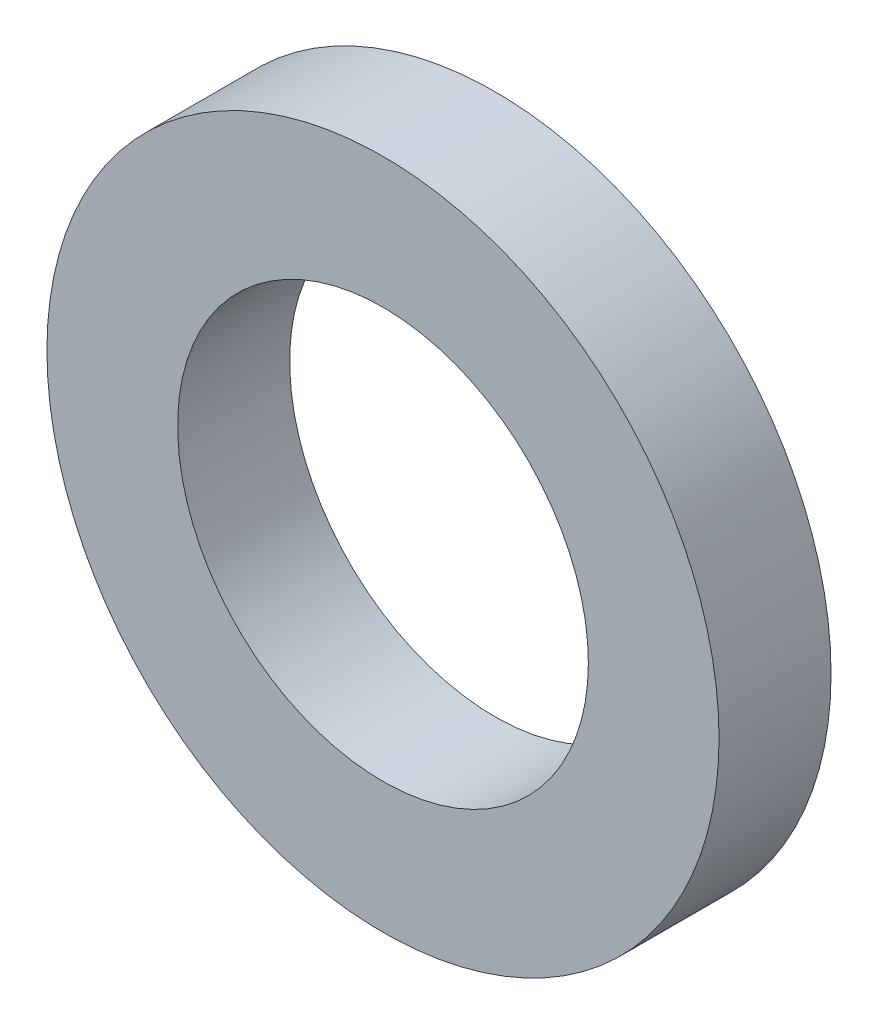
ISO-10303-21;
HEADER;
FILE_DESCRIPTION(('STEP AP214'),'2;1');
FILE_NAME('part.step','',(''),(''),'','','');
FILE_SCHEMA(('AUTOMOTIVE_DESIGN { 1 0 10303 214 1 1 1 1 }'));
ENDSEC;
DATA;
#1=APPLICATION_CONTEXT('core data for automotive mechanical design processes');
#2=APPLICATION_PROTOCOL_DEFINITION('international standard','automotive_design',2000,#1);
#3=PRODUCT_CONTEXT('',#1,'mechanical');
#4=PRODUCT('Part','Part','',(#3));
#5=PRODUCT_RELATED_PRODUCT_CATEGORY('part','',(#4));
#6=PRODUCT_DEFINITION_FORMATION('','',#4);
#7=PRODUCT_DEFINITION_CONTEXT('part definition',#1,'design');
#8=PRODUCT_DEFINITION('design','',#6,#7);
#9=PRODUCT_DEFINITION_SHAPE('','',#8);
#10=(LENGTH_UNIT() NAMED_UNIT(*) SI_UNIT(.MILLI.,.METRE.));
#11=(NAMED_UNIT(*) PLANE_ANGLE_UNIT() SI_UNIT($,.RADIAN.));
#12=(NAMED_UNIT(*) SI_UNIT($,.STERADIAN.) SOLID_ANGLE_UNIT());
#13=UNCERTAINTY_MEASURE_WITH_UNIT(LENGTH_MEASURE(1.E-05),#10,'distance_accuracy_value','');
#14=(GEOMETRIC_REPRESENTATION_CONTEXT(3) GLOBAL_UNCERTAINTY_ASSIGNED_CONTEXT((#13)) GLOBAL_UNIT_ASSIGNED_CONTEXT((#10,
#11,#12)) REPRESENTATION_CONTEXT('',''));
#15=CARTESIAN_POINT('',(0.,0.,0.));
#16=DIRECTION('',(0.,0.,1.));
#17=DIRECTION('',(1.,0.,0.));
#18=AXIS2_PLACEMENT_3D('',#15,#16,#17);
#19=CARTESIAN_POINT('',(0.,0.,1.5));
#20=DIRECTION('',(0.,0.,-1.));
#21=DIRECTION('',(-1.,0.,0.));
#22=AXIS2_PLACEMENT_3D('',#19,#20,#21);
#23=CYLINDRICAL_SURFACE('',#22,4.5);
#24=CARTESIAN_POINT('',(0.,0.,1.5));
#25=DIRECTION('',(0.,0.,1.));
#26=DIRECTION('',(1.,0.,0.));
#27=AXIS2_PLACEMENT_3D('',#24,#25,#26);
#28=CIRCLE('',#27,4.5);
#29=CARTESIAN_POINT('',(4.5,0.,1.5));
#30=VERTEX_POINT('',#29);
#31=EDGE_CURVE('E10',#30,#30,#28,.T.);
#32=ORIENTED_EDGE('',*,*,#31,.F.);
#33=EDGE_LOOP('',(#32));
#34=FACE_BOUND('',#33,.T.);
#35=CARTESIAN_POINT('',(0.,0.,0.));
#36=DIRECTION('',(0.,0.,1.));
#37=DIRECTION('',(1.,0.,0.));
#38=AXIS2_PLACEMENT_3D('',#35,#36,#37);
#39=CIRCLE('',#38,4.5);
#40=CARTESIAN_POINT('',(4.5,0.,0.));
#41=VERTEX_POINT('',#40);
#42=EDGE_CURVE('E37',#41,#41,#39,.T.);
#43=ORIENTED_EDGE('',*,*,#42,.T.);
#44=EDGE_LOOP('',(#43));
#45=FACE_BOUND('',#44,.T.);
#46=ADVANCED_FACE('F31',(#34,#45),#23,.T.);
#47=CARTESIAN_POINT('',(0.,0.,1.5));
#48=DIRECTION('',(0.,0.,1.));
#49=DIRECTION('',(1.,0.,0.));
#50=AXIS2_PLACEMENT_3D('',#47,#48,#49);
#51=PLANE('',#50);
#52=CARTESIAN_POINT('',(0.,0.,1.5));
#53=DIRECTION('',(0.,0.,1.));
#54=DIRECTION('',(1.,0.,0.));
#55=AXIS2_PLACEMENT_3D('',#52,#53,#54);
#56=CIRCLE('',#55,2.75);
#57=CARTESIAN_POINT('',(2.75,0.,1.5));
#58=VERTEX_POINT('',#57);
#59=EDGE_CURVE('E45',#58,#58,#56,.T.);
#60=ORIENTED_EDGE('',*,*,#59,.F.);
#61=EDGE_LOOP('',(#60));
#62=FACE_BOUND('',#61,.T.);
#63=ORIENTED_EDGE('',*,*,#31,.T.);
#64=EDGE_LOOP('',(#63));
#65=FACE_BOUND('',#64,.T.);
#66=ADVANCED_FACE('F53',(#62,#65),#51,.T.);
#67=CARTESIAN_POINT('',(0.,0.,0.));
#68=DIRECTION('',(0.,0.,1.));
#69=DIRECTION('',(1.,0.,0.));
#70=AXIS2_PLACEMENT_3D('',#67,#68,#69);
#71=PLANE('',#70);
#72=CARTESIAN_POINT('',(0.,0.,0.));
#73=DIRECTION('',(0.,0.,1.));
#74=DIRECTION('',(1.,0.,0.));
#75=AXIS2_PLACEMENT_3D('',#72,#73,#74);
#76=CIRCLE('',#75,2.75);
#77=CARTESIAN_POINT('',(2.75,0.,0.));
#78=VERTEX_POINT('',#77);
#79=EDGE_CURVE('E41',#78,#78,#76,.T.);
#80=ORIENTED_EDGE('',*,*,#79,.T.);
#81=EDGE_LOOP('',(#80));
#82=FACE_BOUND('',#81,.T.);
#83=ORIENTED_EDGE('',*,*,#42,.F.);
#84=EDGE_LOOP('',(#83));
#85=FACE_BOUND('',#84,.T.);
#86=ADVANCED_FACE('F55',(#82,#85),#71,.F.);
#87=CARTESIAN_POINT('',(0.,0.,0.));
#88=DIRECTION('',(0.,0.,1.));
#89=DIRECTION('',(1.,0.,0.));
#90=AXIS2_PLACEMENT_3D('',#87,#88,#89);
#91=CYLINDRICAL_SURFACE('',#90,2.75);
#92=ORIENTED_EDGE('',*,*,#79,.F.);
#93=EDGE_LOOP('',(#92));
#94=FACE_BOUND('',#93,.T.);
#95=ORIENTED_EDGE('',*,*,#59,.T.);
#96=EDGE_LOOP('',(#95));
#97=FACE_BOUND('',#96,.T.);
#98=ADVANCED_FACE('F51',(#94,#97),#91,.F.);
#99=CLOSED_SHELL('',(#46,#66,#86,#98));
#100=MANIFOLD_SOLID_BREP('B2',#99);
#101=ADVANCED_BREP_SHAPE_REPRESENTATION('',(#18,#100),#14);
#102=SHAPE_DEFINITION_REPRESENTATION(#9,#101);
ENDSEC;
END-ISO-10303-21;
